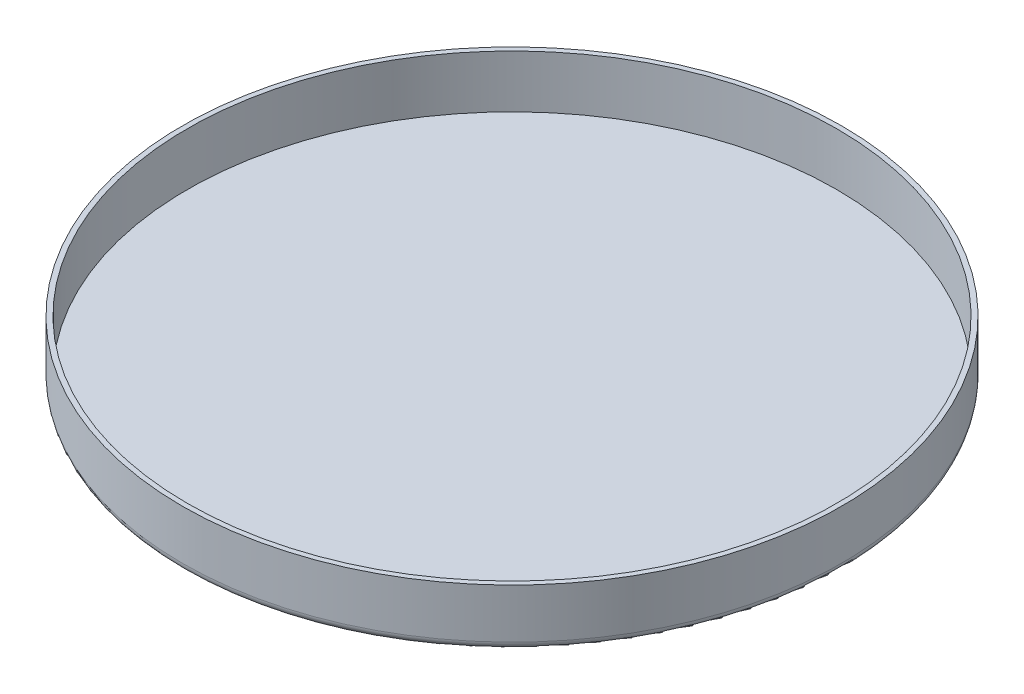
from build123d import *

# Parameters (mm, degrees)
ESBO_O1_R       = 200
EXTRUS_O1_DEPTH = 35
CASCA1_T        = -3
FILETE1_R       = 5


with BuildPart() as part:
    # Esbo_o1 → Extrus_o1 (new body)
    with BuildSketch(Plane(origin=(0, 0, 0), x_dir=(1, 0, 0), z_dir=(0, 1, 0))):
        with Locations(Location((0, 0, 0), (0, 0, 270))):
            Circle(ESBO_O1_R)
    extrude(amount=EXTRUS_O1_DEPTH)

    # Casca1
    casca1_openings = [part.faces().sort_by_distance(p)[0] for p in [
        (0, 35, 0),
    ]]
    offset(amount=CASCA1_T, openings=casca1_openings, kind=Kind.INTERSECTION)

    # Filete1
    filete1_edges = [part.edges().sort_by_distance(p)[0] for p in [
        (0, 0, -200),
    ]]
    fillet(filete1_edges, radius=FILETE1_R)


solid = part.part
